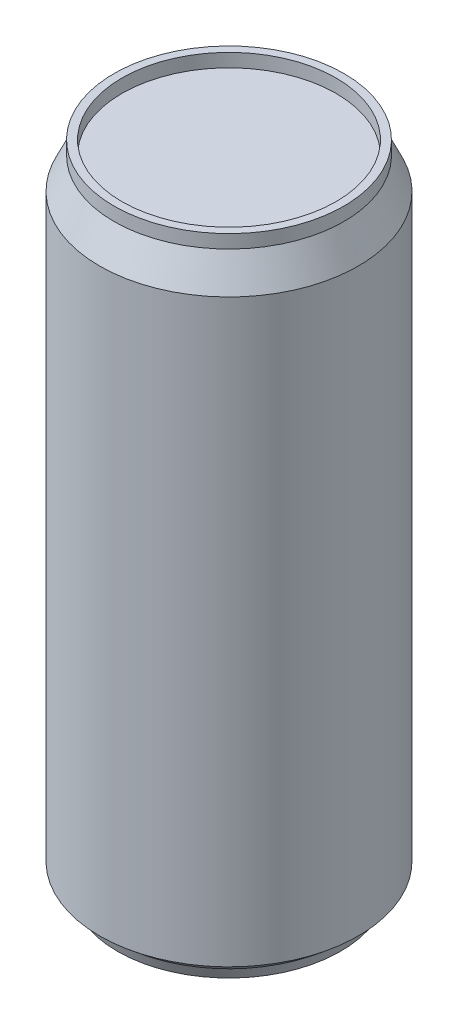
ISO-10303-21;
HEADER;
FILE_DESCRIPTION(('STEP AP214'),'2;1');
FILE_NAME('part.step','',(''),(''),'','','');
FILE_SCHEMA(('AUTOMOTIVE_DESIGN { 1 0 10303 214 1 1 1 1 }'));
ENDSEC;
DATA;
#1=APPLICATION_CONTEXT('core data for automotive mechanical design processes');
#2=APPLICATION_PROTOCOL_DEFINITION('international standard','automotive_design',2000,#1);
#3=PRODUCT_CONTEXT('',#1,'mechanical');
#4=PRODUCT('Part','Part','',(#3));
#5=PRODUCT_RELATED_PRODUCT_CATEGORY('part','',(#4));
#6=PRODUCT_DEFINITION_FORMATION('','',#4);
#7=PRODUCT_DEFINITION_CONTEXT('part definition',#1,'design');
#8=PRODUCT_DEFINITION('design','',#6,#7);
#9=PRODUCT_DEFINITION_SHAPE('','',#8);
#10=(LENGTH_UNIT() NAMED_UNIT(*) SI_UNIT(.MILLI.,.METRE.));
#11=(NAMED_UNIT(*) PLANE_ANGLE_UNIT() SI_UNIT($,.RADIAN.));
#12=(NAMED_UNIT(*) SI_UNIT($,.STERADIAN.) SOLID_ANGLE_UNIT());
#13=UNCERTAINTY_MEASURE_WITH_UNIT(LENGTH_MEASURE(1.E-05),#10,'distance_accuracy_value','');
#14=(GEOMETRIC_REPRESENTATION_CONTEXT(3) GLOBAL_UNCERTAINTY_ASSIGNED_CONTEXT((#13)) GLOBAL_UNIT_ASSIGNED_CONTEXT((#10,
#11,#12)) REPRESENTATION_CONTEXT('',''));
#15=CARTESIAN_POINT('',(0.,0.,0.));
#16=DIRECTION('',(0.,0.,1.));
#17=DIRECTION('',(1.,0.,0.));
#18=AXIS2_PLACEMENT_3D('',#15,#16,#17);
#19=CARTESIAN_POINT('',(0.,142.,0.));
#20=DIRECTION('',(0.,1.,0.));
#21=DIRECTION('',(0.,0.,1.));
#22=AXIS2_PLACEMENT_3D('',#19,#20,#21);
#23=PLANE('',#22);
#24=CARTESIAN_POINT('',(0.,142.,0.));
#25=DIRECTION('',(0.,1.,0.));
#26=DIRECTION('',(0.,0.,1.));
#27=AXIS2_PLACEMENT_3D('',#24,#25,#26);
#28=CIRCLE('',#27,24.);
#29=CARTESIAN_POINT('',(0.,142.,24.));
#30=VERTEX_POINT('',#29);
#31=EDGE_CURVE('E10',#30,#30,#28,.T.);
#32=ORIENTED_EDGE('',*,*,#31,.T.);
#33=EDGE_LOOP('',(#32));
#34=FACE_BOUND('',#33,.T.);
#35=ADVANCED_FACE('F36',(#34),#23,.T.);
#36=CARTESIAN_POINT('',(0.,142.,0.));
#37=DIRECTION('',(0.,1.,0.));
#38=DIRECTION('',(0.,0.,1.));
#39=AXIS2_PLACEMENT_3D('',#36,#37,#38);
#40=CYLINDRICAL_SURFACE('',#39,24.);
#41=CARTESIAN_POINT('',(0.,145.,0.));
#42=DIRECTION('',(0.,1.,0.));
#43=DIRECTION('',(0.,0.,1.));
#44=AXIS2_PLACEMENT_3D('',#41,#42,#43);
#45=CIRCLE('',#44,24.);
#46=CARTESIAN_POINT('',(0.,145.,24.));
#47=VERTEX_POINT('',#46);
#48=EDGE_CURVE('E42',#47,#47,#45,.T.);
#49=ORIENTED_EDGE('',*,*,#48,.T.);
#50=EDGE_LOOP('',(#49));
#51=FACE_BOUND('',#50,.T.);
#52=ORIENTED_EDGE('',*,*,#31,.F.);
#53=EDGE_LOOP('',(#52));
#54=FACE_BOUND('',#53,.T.);
#55=ADVANCED_FACE('F86',(#51,#54),#40,.F.);
#56=CARTESIAN_POINT('',(-24.,145.,0.));
#57=DIRECTION('',(0.,1.,0.));
#58=DIRECTION('',(0.,0.,1.));
#59=AXIS2_PLACEMENT_3D('',#56,#57,#58);
#60=PLANE('',#59);
#61=CARTESIAN_POINT('',(0.,145.,0.));
#62=DIRECTION('',(0.,1.,0.));
#63=DIRECTION('',(0.,0.,1.));
#64=AXIS2_PLACEMENT_3D('',#61,#62,#63);
#65=CIRCLE('',#64,25.75);
#66=CARTESIAN_POINT('',(0.,145.,25.75));
#67=VERTEX_POINT('',#66);
#68=EDGE_CURVE('E46',#67,#67,#65,.T.);
#69=ORIENTED_EDGE('',*,*,#68,.T.);
#70=EDGE_LOOP('',(#69));
#71=FACE_BOUND('',#70,.T.);
#72=ORIENTED_EDGE('',*,*,#48,.F.);
#73=EDGE_LOOP('',(#72));
#74=FACE_BOUND('',#73,.T.);
#75=ADVANCED_FACE('F90',(#71,#74),#60,.T.);
#76=CARTESIAN_POINT('',(0.,142.,0.));
#77=DIRECTION('',(0.,1.,0.));
#78=DIRECTION('',(0.,0.,1.));
#79=AXIS2_PLACEMENT_3D('',#76,#77,#78);
#80=CYLINDRICAL_SURFACE('',#79,25.75);
#81=CARTESIAN_POINT('',(0.,142.,0.));
#82=DIRECTION('',(0.,1.,0.));
#83=DIRECTION('',(0.,0.,1.));
#84=AXIS2_PLACEMENT_3D('',#81,#82,#83);
#85=CIRCLE('',#84,25.75);
#86=CARTESIAN_POINT('',(0.,142.,25.75));
#87=VERTEX_POINT('',#86);
#88=EDGE_CURVE('E50',#87,#87,#85,.T.);
#89=ORIENTED_EDGE('',*,*,#88,.T.);
#90=EDGE_LOOP('',(#89));
#91=FACE_BOUND('',#90,.T.);
#92=ORIENTED_EDGE('',*,*,#68,.F.);
#93=EDGE_LOOP('',(#92));
#94=FACE_BOUND('',#93,.T.);
#95=ADVANCED_FACE('F94',(#91,#94),#80,.T.);
#96=CARTESIAN_POINT('',(0.,142.,0.));
#97=DIRECTION('',(0.,-1.,0.));
#98=DIRECTION('',(0.,0.,-1.));
#99=AXIS2_PLACEMENT_3D('',#96,#97,#98);
#100=CONICAL_SURFACE('',#99,25.75,0.434670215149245);
#101=CARTESIAN_POINT('',(0.,135.,0.));
#102=DIRECTION('',(0.,1.,0.));
#103=DIRECTION('',(0.,0.,1.));
#104=AXIS2_PLACEMENT_3D('',#101,#102,#103);
#105=CIRCLE('',#104,29.);
#106=CARTESIAN_POINT('',(0.,135.,29.));
#107=VERTEX_POINT('',#106);
#108=EDGE_CURVE('E55',#107,#107,#105,.T.);
#109=ORIENTED_EDGE('',*,*,#108,.T.);
#110=EDGE_LOOP('',(#109));
#111=FACE_BOUND('',#110,.T.);
#112=ORIENTED_EDGE('',*,*,#88,.F.);
#113=EDGE_LOOP('',(#112));
#114=FACE_BOUND('',#113,.T.);
#115=ADVANCED_FACE('F101',(#111,#114),#100,.T.);
#116=CARTESIAN_POINT('',(0.,142.,0.));
#117=DIRECTION('',(0.,1.,0.));
#118=DIRECTION('',(0.,0.,1.));
#119=AXIS2_PLACEMENT_3D('',#116,#117,#118);
#120=CYLINDRICAL_SURFACE('',#119,29.);
#121=CARTESIAN_POINT('',(0.,5.,0.));
#122=DIRECTION('',(0.,1.,0.));
#123=DIRECTION('',(0.,0.,1.));
#124=AXIS2_PLACEMENT_3D('',#121,#122,#123);
#125=CIRCLE('',#124,29.);
#126=CARTESIAN_POINT('',(0.,5.,29.));
#127=VERTEX_POINT('',#126);
#128=EDGE_CURVE('E58',#127,#127,#125,.T.);
#129=ORIENTED_EDGE('',*,*,#128,.T.);
#130=EDGE_LOOP('',(#129));
#131=FACE_BOUND('',#130,.T.);
#132=ORIENTED_EDGE('',*,*,#108,.F.);
#133=EDGE_LOOP('',(#132));
#134=FACE_BOUND('',#133,.T.);
#135=ADVANCED_FACE('F105',(#131,#134),#120,.T.);
#136=CARTESIAN_POINT('',(0.,5.,0.));
#137=DIRECTION('',(0.,1.,0.));
#138=DIRECTION('',(0.,0.,1.));
#139=AXIS2_PLACEMENT_3D('',#136,#137,#138);
#140=CONICAL_SURFACE('',#139,29.,0.876058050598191);
#141=CARTESIAN_POINT('',(0.,2.5,0.));
#142=DIRECTION('',(0.,1.,0.));
#143=DIRECTION('',(0.,0.,1.));
#144=AXIS2_PLACEMENT_3D('',#141,#142,#143);
#145=CIRCLE('',#144,26.);
#146=CARTESIAN_POINT('',(0.,2.5,26.));
#147=VERTEX_POINT('',#146);
#148=EDGE_CURVE('E61',#147,#147,#145,.T.);
#149=ORIENTED_EDGE('',*,*,#148,.T.);
#150=EDGE_LOOP('',(#149));
#151=FACE_BOUND('',#150,.T.);
#152=ORIENTED_EDGE('',*,*,#128,.F.);
#153=EDGE_LOOP('',(#152));
#154=FACE_BOUND('',#153,.T.);
#155=ADVANCED_FACE('F109',(#151,#154),#140,.T.);
#156=CARTESIAN_POINT('',(0.,2.5,0.));
#157=DIRECTION('',(0.,1.,0.));
#158=DIRECTION('',(0.,0.,1.));
#159=AXIS2_PLACEMENT_3D('',#156,#157,#158);
#160=CONICAL_SURFACE('',#159,26.,0.380506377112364);
#161=CARTESIAN_POINT('',(0.,0.,0.));
#162=DIRECTION('',(0.,1.,0.));
#163=DIRECTION('',(0.,0.,1.));
#164=AXIS2_PLACEMENT_3D('',#161,#162,#163);
#165=CIRCLE('',#164,25.);
#166=CARTESIAN_POINT('',(0.,0.,25.));
#167=VERTEX_POINT('',#166);
#168=EDGE_CURVE('E64',#167,#167,#165,.T.);
#169=ORIENTED_EDGE('',*,*,#168,.T.);
#170=EDGE_LOOP('',(#169));
#171=FACE_BOUND('',#170,.T.);
#172=ORIENTED_EDGE('',*,*,#148,.F.);
#173=EDGE_LOOP('',(#172));
#174=FACE_BOUND('',#173,.T.);
#175=ADVANCED_FACE('F113',(#171,#174),#160,.T.);
#176=CARTESIAN_POINT('',(-25.,0.,0.));
#177=DIRECTION('',(0.,-1.,0.));
#178=DIRECTION('',(0.,0.,-1.));
#179=AXIS2_PLACEMENT_3D('',#176,#177,#178);
#180=PLANE('',#179);
#181=CARTESIAN_POINT('',(0.,0.,0.));
#182=DIRECTION('',(0.,1.,0.));
#183=DIRECTION('',(0.,0.,1.));
#184=AXIS2_PLACEMENT_3D('',#181,#182,#183);
#185=CIRCLE('',#184,22.);
#186=CARTESIAN_POINT('',(0.,0.,22.));
#187=VERTEX_POINT('',#186);
#188=EDGE_CURVE('E67',#187,#187,#185,.T.);
#189=ORIENTED_EDGE('',*,*,#188,.T.);
#190=EDGE_LOOP('',(#189));
#191=FACE_BOUND('',#190,.T.);
#192=ORIENTED_EDGE('',*,*,#168,.F.);
#193=EDGE_LOOP('',(#192));
#194=FACE_BOUND('',#193,.T.);
#195=ADVANCED_FACE('F83',(#191,#194),#180,.T.);
#196=CARTESIAN_POINT('',(0.,142.,0.));
#197=DIRECTION('',(0.,1.,0.));
#198=DIRECTION('',(0.,0.,1.));
#199=AXIS2_PLACEMENT_3D('',#196,#197,#198);
#200=CYLINDRICAL_SURFACE('',#199,22.);
#201=CARTESIAN_POINT('',(0.,2.5,0.));
#202=DIRECTION('',(0.,1.,0.));
#203=DIRECTION('',(0.,0.,1.));
#204=AXIS2_PLACEMENT_3D('',#201,#202,#203);
#205=CIRCLE('',#204,22.);
#206=CARTESIAN_POINT('',(0.,2.5,22.));
#207=VERTEX_POINT('',#206);
#208=EDGE_CURVE('E70',#207,#207,#205,.T.);
#209=ORIENTED_EDGE('',*,*,#208,.T.);
#210=EDGE_LOOP('',(#209));
#211=FACE_BOUND('',#210,.T.);
#212=ORIENTED_EDGE('',*,*,#188,.F.);
#213=EDGE_LOOP('',(#212));
#214=FACE_BOUND('',#213,.T.);
#215=ADVANCED_FACE('F74',(#211,#214),#200,.F.);
#216=CARTESIAN_POINT('',(0.,-26.0166666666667,0.));
#217=DIRECTION('',(0.,1.,0.));
#218=DIRECTION('',(-1.,0.,0.));
#219=AXIS2_PLACEMENT_3D('',#216,#217,#218);
#220=SPHERICAL_SURFACE('',#219,36.0166666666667);
#221=ORIENTED_EDGE('',*,*,#208,.F.);
#222=EDGE_LOOP('',(#221));
#223=FACE_BOUND('',#222,.T.);
#224=ADVANCED_FACE('F77',(#223),#220,.F.);
#225=CLOSED_SHELL('',(#35,#55,#75,#95,#115,#135,#155,#175,#195,#215,#224));
#226=MANIFOLD_SOLID_BREP('B2',#225);
#227=ADVANCED_BREP_SHAPE_REPRESENTATION('',(#18,#226),#14);
#228=SHAPE_DEFINITION_REPRESENTATION(#9,#227);
ENDSEC;
END-ISO-10303-21;
